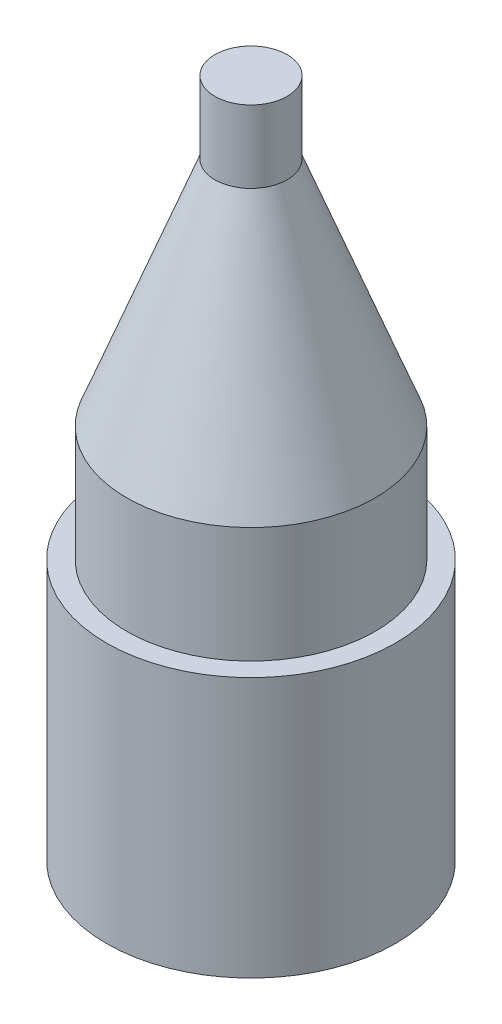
ISO-10303-21;
HEADER;
FILE_DESCRIPTION(('STEP AP214'),'2;1');
FILE_NAME('part.step','',(''),(''),'','','');
FILE_SCHEMA(('AUTOMOTIVE_DESIGN { 1 0 10303 214 1 1 1 1 }'));
ENDSEC;
DATA;
#1=APPLICATION_CONTEXT('core data for automotive mechanical design processes');
#2=APPLICATION_PROTOCOL_DEFINITION('international standard','automotive_design',2000,#1);
#3=PRODUCT_CONTEXT('',#1,'mechanical');
#4=PRODUCT('Part','Part','',(#3));
#5=PRODUCT_RELATED_PRODUCT_CATEGORY('part','',(#4));
#6=PRODUCT_DEFINITION_FORMATION('','',#4);
#7=PRODUCT_DEFINITION_CONTEXT('part definition',#1,'design');
#8=PRODUCT_DEFINITION('design','',#6,#7);
#9=PRODUCT_DEFINITION_SHAPE('','',#8);
#10=(LENGTH_UNIT() NAMED_UNIT(*) SI_UNIT(.MILLI.,.METRE.));
#11=(NAMED_UNIT(*) PLANE_ANGLE_UNIT() SI_UNIT($,.RADIAN.));
#12=(NAMED_UNIT(*) SI_UNIT($,.STERADIAN.) SOLID_ANGLE_UNIT());
#13=UNCERTAINTY_MEASURE_WITH_UNIT(LENGTH_MEASURE(1.E-05),#10,'distance_accuracy_value','');
#14=(GEOMETRIC_REPRESENTATION_CONTEXT(3) GLOBAL_UNCERTAINTY_ASSIGNED_CONTEXT((#13)) GLOBAL_UNIT_ASSIGNED_CONTEXT((#10,
#11,#12)) REPRESENTATION_CONTEXT('',''));
#15=CARTESIAN_POINT('',(0.,0.,0.));
#16=DIRECTION('',(0.,0.,1.));
#17=DIRECTION('',(1.,0.,0.));
#18=AXIS2_PLACEMENT_3D('',#15,#16,#17);
#19=CARTESIAN_POINT('',(0.,22.86,0.));
#20=DIRECTION('',(0.,1.,0.));
#21=DIRECTION('',(0.,0.,1.));
#22=AXIS2_PLACEMENT_3D('',#19,#20,#21);
#23=PLANE('',#22);
#24=CARTESIAN_POINT('',(0.,22.86,0.));
#25=DIRECTION('',(0.,1.,0.));
#26=DIRECTION('',(0.,0.,1.));
#27=AXIS2_PLACEMENT_3D('',#24,#25,#26);
#28=CIRCLE('',#27,12.7);
#29=CARTESIAN_POINT('',(0.,22.86,12.7));
#30=VERTEX_POINT('',#29);
#31=EDGE_CURVE('E10',#30,#30,#28,.T.);
#32=ORIENTED_EDGE('',*,*,#31,.T.);
#33=EDGE_LOOP('',(#32));
#34=FACE_BOUND('',#33,.T.);
#35=CARTESIAN_POINT('',(0.,22.86,0.));
#36=DIRECTION('',(0.,-1.,0.));
#37=DIRECTION('',(0.,0.,-1.));
#38=AXIS2_PLACEMENT_3D('',#35,#36,#37);
#39=CIRCLE('',#38,10.922);
#40=CARTESIAN_POINT('',(0.,22.86,-10.922));
#41=VERTEX_POINT('',#40);
#42=EDGE_CURVE('E40',#41,#41,#39,.T.);
#43=ORIENTED_EDGE('',*,*,#42,.T.);
#44=EDGE_LOOP('',(#43));
#45=FACE_BOUND('',#44,.T.);
#46=ADVANCED_FACE('F29',(#34,#45),#23,.T.);
#47=CARTESIAN_POINT('',(0.,22.86,0.));
#48=DIRECTION('',(0.,-1.,0.));
#49=DIRECTION('',(0.,0.,-1.));
#50=AXIS2_PLACEMENT_3D('',#47,#48,#49);
#51=CYLINDRICAL_SURFACE('',#50,12.7);
#52=ORIENTED_EDGE('',*,*,#31,.F.);
#53=EDGE_LOOP('',(#52));
#54=FACE_BOUND('',#53,.T.);
#55=CARTESIAN_POINT('',(0.,0.,0.));
#56=DIRECTION('',(0.,1.,0.));
#57=DIRECTION('',(0.,0.,1.));
#58=AXIS2_PLACEMENT_3D('',#55,#56,#57);
#59=CIRCLE('',#58,12.7);
#60=CARTESIAN_POINT('',(0.,0.,12.7));
#61=VERTEX_POINT('',#60);
#62=EDGE_CURVE('E33',#61,#61,#59,.T.);
#63=ORIENTED_EDGE('',*,*,#62,.T.);
#64=EDGE_LOOP('',(#63));
#65=FACE_BOUND('',#64,.T.);
#66=ADVANCED_FACE('F31',(#54,#65),#51,.T.);
#67=CARTESIAN_POINT('',(0.,0.,0.));
#68=DIRECTION('',(0.,1.,0.));
#69=DIRECTION('',(0.,0.,1.));
#70=AXIS2_PLACEMENT_3D('',#67,#68,#69);
#71=PLANE('',#70);
#72=ORIENTED_EDGE('',*,*,#62,.F.);
#73=EDGE_LOOP('',(#72));
#74=FACE_BOUND('',#73,.T.);
#75=ADVANCED_FACE('F70',(#74),#71,.F.);
#76=CARTESIAN_POINT('',(0.,0.,0.));
#77=DIRECTION('',(0.,-1.,0.));
#78=DIRECTION('',(0.,0.,-1.));
#79=AXIS2_PLACEMENT_3D('',#76,#77,#78);
#80=CYLINDRICAL_SURFACE('',#79,10.922);
#81=ORIENTED_EDGE('',*,*,#42,.F.);
#82=EDGE_LOOP('',(#81));
#83=FACE_BOUND('',#82,.T.);
#84=CARTESIAN_POINT('',(0.,33.02,0.));
#85=DIRECTION('',(0.,-1.,0.));
#86=DIRECTION('',(0.,0.,-1.));
#87=AXIS2_PLACEMENT_3D('',#84,#85,#86);
#88=CIRCLE('',#87,10.922);
#89=CARTESIAN_POINT('',(0.,33.02,-10.922));
#90=VERTEX_POINT('',#89);
#91=EDGE_CURVE('E44',#90,#90,#88,.T.);
#92=ORIENTED_EDGE('',*,*,#91,.T.);
#93=EDGE_LOOP('',(#92));
#94=FACE_BOUND('',#93,.T.);
#95=ADVANCED_FACE('F74',(#83,#94),#80,.T.);
#96=CARTESIAN_POINT('',(0.,53.34,0.));
#97=DIRECTION('',(0.,-1.,0.));
#98=DIRECTION('',(0.,0.,-1.));
#99=AXIS2_PLACEMENT_3D('',#96,#97,#98);
#100=CONICAL_SURFACE('',#99,3.175,0.364238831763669);
#101=CARTESIAN_POINT('',(0.,53.34,0.));
#102=DIRECTION('',(0.,-1.,0.));
#103=DIRECTION('',(0.,0.,-1.));
#104=AXIS2_PLACEMENT_3D('',#101,#102,#103);
#105=CIRCLE('',#104,3.175);
#106=CARTESIAN_POINT('',(0.,53.34,-3.175));
#107=VERTEX_POINT('',#106);
#108=EDGE_CURVE('E47',#107,#107,#105,.T.);
#109=CARTESIAN_POINT('',(0.,33.02,-10.922));
#110=CARTESIAN_POINT('',(0.,33.2316666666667,-10.8413020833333));
#111=CARTESIAN_POINT('',(0.,33.4433333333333,-10.7606041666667));
#112=CARTESIAN_POINT('',(0.,33.8666666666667,-10.5992083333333));
#113=CARTESIAN_POINT('',(0.,34.0783333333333,-10.5185104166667));
#114=CARTESIAN_POINT('',(0.,34.5016666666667,-10.3571145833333));
#115=CARTESIAN_POINT('',(0.,34.7133333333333,-10.2764166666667));
#116=CARTESIAN_POINT('',(0.,35.1366666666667,-10.1150208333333));
#117=CARTESIAN_POINT('',(0.,35.3483333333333,-10.0343229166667));
#118=CARTESIAN_POINT('',(0.,35.7716666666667,-9.87292708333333));
#119=CARTESIAN_POINT('',(0.,35.9833333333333,-9.79222916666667));
#120=CARTESIAN_POINT('',(0.,36.4066666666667,-9.63083333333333));
#121=CARTESIAN_POINT('',(0.,36.6183333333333,-9.55013541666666));
#122=CARTESIAN_POINT('',(0.,37.0416666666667,-9.38873958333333));
#123=CARTESIAN_POINT('',(0.,37.2533333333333,-9.30804166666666));
#124=CARTESIAN_POINT('',(0.,37.6766666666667,-9.14664583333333));
#125=CARTESIAN_POINT('',(0.,37.8883333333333,-9.06594791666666));
#126=CARTESIAN_POINT('',(0.,38.3116666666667,-8.90455208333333));
#127=CARTESIAN_POINT('',(0.,38.5233333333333,-8.82385416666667));
#128=CARTESIAN_POINT('',(0.,38.9466666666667,-8.66245833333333));
#129=CARTESIAN_POINT('',(0.,39.1583333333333,-8.58176041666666));
#130=CARTESIAN_POINT('',(0.,39.5816666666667,-8.42036458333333));
#131=CARTESIAN_POINT('',(0.,39.7933333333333,-8.33966666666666));
#132=CARTESIAN_POINT('',(0.,40.2166666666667,-8.17827083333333));
#133=CARTESIAN_POINT('',(0.,40.4283333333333,-8.09757291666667));
#134=CARTESIAN_POINT('',(0.,40.8516666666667,-7.93617708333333));
#135=CARTESIAN_POINT('',(0.,41.0633333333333,-7.85547916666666));
#136=CARTESIAN_POINT('',(0.,41.4866666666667,-7.69408333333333));
#137=CARTESIAN_POINT('',(0.,41.6983333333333,-7.61338541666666));
#138=CARTESIAN_POINT('',(0.,42.1216666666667,-7.45198958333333));
#139=CARTESIAN_POINT('',(0.,42.3333333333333,-7.37129166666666));
#140=CARTESIAN_POINT('',(0.,42.7566666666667,-7.20989583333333));
#141=CARTESIAN_POINT('',(0.,42.9683333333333,-7.12919791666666));
#142=CARTESIAN_POINT('',(0.,43.3916666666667,-6.96780208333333));
#143=CARTESIAN_POINT('',(0.,43.6033333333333,-6.88710416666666));
#144=CARTESIAN_POINT('',(0.,44.0266666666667,-6.72570833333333));
#145=CARTESIAN_POINT('',(0.,44.2383333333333,-6.64501041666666));
#146=CARTESIAN_POINT('',(0.,44.6616666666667,-6.48361458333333));
#147=CARTESIAN_POINT('',(0.,44.8733333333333,-6.40291666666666));
#148=CARTESIAN_POINT('',(0.,45.2966666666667,-6.24152083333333));
#149=CARTESIAN_POINT('',(0.,45.5083333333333,-6.16082291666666));
#150=CARTESIAN_POINT('',(0.,45.9316666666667,-5.99942708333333));
#151=CARTESIAN_POINT('',(0.,46.1433333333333,-5.91872916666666));
#152=CARTESIAN_POINT('',(0.,46.5666666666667,-5.75733333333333));
#153=CARTESIAN_POINT('',(0.,46.7783333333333,-5.67663541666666));
#154=CARTESIAN_POINT('',(0.,47.2016666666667,-5.51523958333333));
#155=CARTESIAN_POINT('',(0.,47.4133333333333,-5.43454166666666));
#156=CARTESIAN_POINT('',(0.,47.8366666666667,-5.27314583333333));
#157=CARTESIAN_POINT('',(0.,48.0483333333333,-5.19244791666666));
#158=CARTESIAN_POINT('',(0.,48.4716666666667,-5.03105208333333));
#159=CARTESIAN_POINT('',(0.,48.6833333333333,-4.95035416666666));
#160=CARTESIAN_POINT('',(0.,49.1066666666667,-4.78895833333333));
#161=CARTESIAN_POINT('',(0.,49.3183333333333,-4.70826041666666));
#162=CARTESIAN_POINT('',(0.,49.7416666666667,-4.54686458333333));
#163=CARTESIAN_POINT('',(0.,49.9533333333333,-4.46616666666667));
#164=CARTESIAN_POINT('',(0.,50.3766666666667,-4.30477083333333));
#165=CARTESIAN_POINT('',(0.,50.5883333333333,-4.22407291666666));
#166=CARTESIAN_POINT('',(0.,51.0116666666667,-4.06267708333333));
#167=CARTESIAN_POINT('',(0.,51.2233333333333,-3.98197916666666));
#168=CARTESIAN_POINT('',(0.,51.6466666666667,-3.82058333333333));
#169=CARTESIAN_POINT('',(0.,51.8583333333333,-3.73988541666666));
#170=CARTESIAN_POINT('',(0.,52.2816666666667,-3.57848958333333));
#171=CARTESIAN_POINT('',(0.,52.4933333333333,-3.49779166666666));
#172=CARTESIAN_POINT('',(0.,52.9166666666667,-3.33639583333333));
#173=CARTESIAN_POINT('',(0.,53.1283333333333,-3.25569791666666));
#174=CARTESIAN_POINT('',(0.,53.34,-3.175));
#175=B_SPLINE_CURVE_WITH_KNOTS('',3,(#109,#110,#111,#112,#113,#114,#115,#116,#117,#118,#119,
#120,#121,#122,#123,#124,#125,#126,#127,#128,#129,#130,#131,#132,#133,#134,#135,#136,#137,#138,
#139,#140,#141,#142,#143,#144,#145,#146,#147,#148,#149,#150,#151,#152,#153,#154,#155,#156,#157,
#158,#159,#160,#161,#162,#163,#164,#165,#166,#167,#168,#169,#170,#171,#172,#173,#174),
.UNSPECIFIED.,.F.,.F.,(4,2,2,2,2,2,2,2,2,2,2,2,2,2,2,2,2,2,2,2,2,2,2,2,2,2,2,2,2,2,2,2,4),(0.,
0.679583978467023,1.35916795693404,2.03875193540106,2.71833591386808,3.3979198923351,
4.07750387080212,4.75708784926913,5.43667182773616,6.11625580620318,6.7958397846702,
7.47542376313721,8.15500774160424,8.83459172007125,9.51417569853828,10.1937596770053,
10.8733436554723,11.5529276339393,12.2325116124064,12.9120955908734,13.5916795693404,
14.2712635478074,14.9508475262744,15.6304315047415,16.3100154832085,16.9895994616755,
17.6691834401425,18.3487674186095,19.0283513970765,19.7079353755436,20.3875193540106,
21.0671033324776,21.7466873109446),.UNSPECIFIED.);
#176=EDGE_CURVE('BSEAM62',#90,#107,#175,.T.);
#177=ORIENTED_EDGE('',*,*,#91,.F.);
#178=ORIENTED_EDGE('',*,*,#108,.T.);
#179=ORIENTED_EDGE('',*,*,#176,.T.);
#180=ORIENTED_EDGE('',*,*,#176,.F.);
#181=EDGE_LOOP('',(#177,#179,#178,#180));
#182=FACE_BOUND('',#181,.T.);
#183=ADVANCED_FACE('F62',(#182),#100,.T.);
#184=CARTESIAN_POINT('',(0.,0.,0.));
#185=DIRECTION('',(0.,-1.,0.));
#186=DIRECTION('',(0.,0.,-1.));
#187=AXIS2_PLACEMENT_3D('',#184,#185,#186);
#188=CYLINDRICAL_SURFACE('',#187,3.175);
#189=ORIENTED_EDGE('',*,*,#108,.F.);
#190=EDGE_LOOP('',(#189));
#191=FACE_BOUND('',#190,.T.);
#192=CARTESIAN_POINT('',(0.,59.69,0.));
#193=DIRECTION('',(0.,-1.,0.));
#194=DIRECTION('',(0.,0.,-1.));
#195=AXIS2_PLACEMENT_3D('',#192,#193,#194);
#196=CIRCLE('',#195,3.175);
#197=CARTESIAN_POINT('',(0.,59.69,-3.175));
#198=VERTEX_POINT('',#197);
#199=EDGE_CURVE('E50',#198,#198,#196,.T.);
#200=ORIENTED_EDGE('',*,*,#199,.T.);
#201=EDGE_LOOP('',(#200));
#202=FACE_BOUND('',#201,.T.);
#203=ADVANCED_FACE('F54',(#191,#202),#188,.T.);
#204=CARTESIAN_POINT('',(-3.175,59.69,0.));
#205=DIRECTION('',(0.,-1.,0.));
#206=DIRECTION('',(0.,0.,-1.));
#207=AXIS2_PLACEMENT_3D('',#204,#205,#206);
#208=PLANE('',#207);
#209=ORIENTED_EDGE('',*,*,#199,.F.);
#210=EDGE_LOOP('',(#209));
#211=FACE_BOUND('',#210,.T.);
#212=ADVANCED_FACE('F56',(#211),#208,.F.);
#213=CLOSED_SHELL('',(#46,#66,#75,#95,#183,#203,#212));
#214=MANIFOLD_SOLID_BREP('B2',#213);
#215=ADVANCED_BREP_SHAPE_REPRESENTATION('',(#18,#214),#14);
#216=SHAPE_DEFINITION_REPRESENTATION(#9,#215);
ENDSEC;
END-ISO-10303-21;
